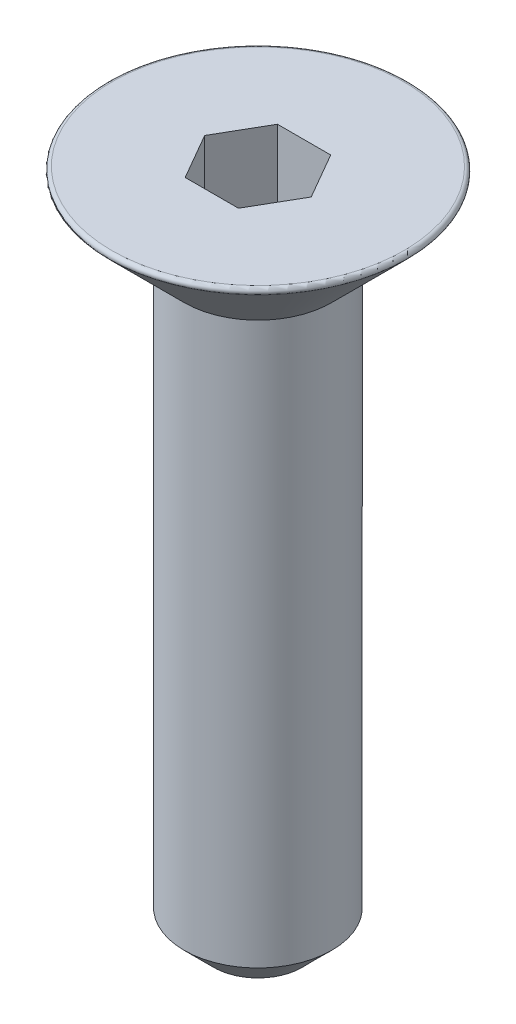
ISO-10303-21;
HEADER;
FILE_DESCRIPTION(('STEP AP214'),'2;1');
FILE_NAME('part.step','',(''),(''),'','','');
FILE_SCHEMA(('AUTOMOTIVE_DESIGN { 1 0 10303 214 1 1 1 1 }'));
ENDSEC;
DATA;
#1=APPLICATION_CONTEXT('core data for automotive mechanical design processes');
#2=APPLICATION_PROTOCOL_DEFINITION('international standard','automotive_design',2000,#1);
#3=PRODUCT_CONTEXT('',#1,'mechanical');
#4=PRODUCT('Part','Part','',(#3));
#5=PRODUCT_RELATED_PRODUCT_CATEGORY('part','',(#4));
#6=PRODUCT_DEFINITION_FORMATION('','',#4);
#7=PRODUCT_DEFINITION_CONTEXT('part definition',#1,'design');
#8=PRODUCT_DEFINITION('design','',#6,#7);
#9=PRODUCT_DEFINITION_SHAPE('','',#8);
#10=(LENGTH_UNIT() NAMED_UNIT(*) SI_UNIT(.MILLI.,.METRE.));
#11=(NAMED_UNIT(*) PLANE_ANGLE_UNIT() SI_UNIT($,.RADIAN.));
#12=(NAMED_UNIT(*) SI_UNIT($,.STERADIAN.) SOLID_ANGLE_UNIT());
#13=UNCERTAINTY_MEASURE_WITH_UNIT(LENGTH_MEASURE(1.E-05),#10,'distance_accuracy_value','');
#14=(GEOMETRIC_REPRESENTATION_CONTEXT(3) GLOBAL_UNCERTAINTY_ASSIGNED_CONTEXT((#13)) GLOBAL_UNIT_ASSIGNED_CONTEXT((#10,
#11,#12)) REPRESENTATION_CONTEXT('',''));
#15=CARTESIAN_POINT('',(0.,0.,0.));
#16=DIRECTION('',(0.,0.,1.));
#17=DIRECTION('',(1.,0.,0.));
#18=AXIS2_PLACEMENT_3D('',#15,#16,#17);
#19=CARTESIAN_POINT('',(0.,0.,0.));
#20=DIRECTION('',(0.,1.,0.));
#21=DIRECTION('',(0.,0.,1.));
#22=AXIS2_PLACEMENT_3D('',#19,#20,#21);
#23=PLANE('',#22);
#24=DIRECTION('',(0.5,0.,-0.866025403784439));
#25=VECTOR('',#24,1.);
#26=CARTESIAN_POINT('',(0.721687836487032,0.,1.25));
#27=LINE('',#26,#25);
#28=CARTESIAN_POINT('',(0.721687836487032,0.,1.25));
#29=VERTEX_POINT('',#28);
#30=CARTESIAN_POINT('',(1.44337567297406,0.,0.));
#31=VERTEX_POINT('',#30);
#32=EDGE_CURVE('E48',#29,#31,#27,.T.);
#33=ORIENTED_EDGE('',*,*,#32,.F.);
#34=DIRECTION('',(1.,0.,0.));
#35=VECTOR('',#34,1.);
#36=CARTESIAN_POINT('',(-0.721687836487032,0.,1.25));
#37=LINE('',#36,#35);
#38=CARTESIAN_POINT('',(-0.721687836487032,0.,1.25));
#39=VERTEX_POINT('',#38);
#40=EDGE_CURVE('E131',#39,#29,#37,.T.);
#41=ORIENTED_EDGE('',*,*,#40,.F.);
#42=DIRECTION('',(0.5,0.,0.866025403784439));
#43=VECTOR('',#42,1.);
#44=CARTESIAN_POINT('',(-1.44337567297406,0.,0.));
#45=LINE('',#44,#43);
#46=CARTESIAN_POINT('',(-1.44337567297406,0.,0.));
#47=VERTEX_POINT('',#46);
#48=EDGE_CURVE('E129',#47,#39,#45,.T.);
#49=ORIENTED_EDGE('',*,*,#48,.F.);
#50=DIRECTION('',(-0.5,0.,0.866025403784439));
#51=VECTOR('',#50,1.);
#52=CARTESIAN_POINT('',(-0.721687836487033,0.,-1.25));
#53=LINE('',#52,#51);
#54=CARTESIAN_POINT('',(-0.721687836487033,0.,-1.25));
#55=VERTEX_POINT('',#54);
#56=EDGE_CURVE('E96',#55,#47,#53,.T.);
#57=ORIENTED_EDGE('',*,*,#56,.F.);
#58=DIRECTION('',(-1.,0.,0.));
#59=VECTOR('',#58,1.);
#60=CARTESIAN_POINT('',(0.721687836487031,0.,-1.25));
#61=LINE('',#60,#59);
#62=CARTESIAN_POINT('',(0.721687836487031,0.,-1.25));
#63=VERTEX_POINT('',#62);
#64=EDGE_CURVE('E125',#63,#55,#61,.T.);
#65=ORIENTED_EDGE('',*,*,#64,.F.);
#66=DIRECTION('',(-0.5,0.,-0.866025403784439));
#67=VECTOR('',#66,1.);
#68=CARTESIAN_POINT('',(1.44337567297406,0.,0.));
#69=LINE('',#68,#67);
#70=EDGE_CURVE('E122',#31,#63,#69,.T.);
#71=ORIENTED_EDGE('',*,*,#70,.F.);
#72=EDGE_LOOP('',(#33,#41,#49,#57,#65,#71));
#73=FACE_BOUND('',#72,.T.);
#74=CARTESIAN_POINT('',(0.,0.,0.));
#75=DIRECTION('',(0.,1.,0.));
#76=DIRECTION('',(0.,0.,1.));
#77=AXIS2_PLACEMENT_3D('',#74,#75,#76);
#78=CIRCLE('',#77,3.95857864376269);
#79=CARTESIAN_POINT('',(0.,0.,3.95857864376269));
#80=VERTEX_POINT('',#79);
#81=EDGE_CURVE('E143',#80,#80,#78,.T.);
#82=ORIENTED_EDGE('',*,*,#81,.T.);
#83=EDGE_LOOP('',(#82));
#84=FACE_BOUND('',#83,.T.);
#85=ADVANCED_FACE('F33',(#73,#84),#23,.T.);
#86=CARTESIAN_POINT('',(0.,0.,0.));
#87=DIRECTION('',(0.,1.,0.));
#88=DIRECTION('',(0.,0.,1.));
#89=AXIS2_PLACEMENT_3D('',#86,#87,#88);
#90=CONICAL_SURFACE('',#89,4.2,0.78539816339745);
#91=CARTESIAN_POINT('',(0.,-0.170710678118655,0.));
#92=DIRECTION('',(0.,-1.,0.));
#93=DIRECTION('',(0.,0.,-1.));
#94=AXIS2_PLACEMENT_3D('',#91,#92,#93);
#95=CIRCLE('',#94,4.02928932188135);
#96=CARTESIAN_POINT('',(0.,-0.170710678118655,-4.02928932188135));
#97=VERTEX_POINT('',#96);
#98=EDGE_CURVE('E146',#97,#97,#95,.T.);
#99=ORIENTED_EDGE('',*,*,#98,.T.);
#100=EDGE_LOOP('',(#99));
#101=FACE_BOUND('',#100,.T.);
#102=CARTESIAN_POINT('',(0.,-2.19999999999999,0.));
#103=DIRECTION('',(0.,1.,0.));
#104=DIRECTION('',(0.,0.,1.));
#105=AXIS2_PLACEMENT_3D('',#102,#103,#104);
#106=CIRCLE('',#105,2.);
#107=CARTESIAN_POINT('',(0.,-2.19999999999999,2.));
#108=VERTEX_POINT('',#107);
#109=EDGE_CURVE('E135',#108,#108,#106,.T.);
#110=ORIENTED_EDGE('',*,*,#109,.T.);
#111=EDGE_LOOP('',(#110));
#112=FACE_BOUND('',#111,.T.);
#113=ADVANCED_FACE('F168',(#101,#112),#90,.T.);
#114=CARTESIAN_POINT('',(0.,15.4879719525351,0.));
#115=DIRECTION('',(0.,1.,0.));
#116=DIRECTION('',(0.,0.,1.));
#117=AXIS2_PLACEMENT_3D('',#114,#115,#116);
#118=CYLINDRICAL_SURFACE('',#117,2.);
#119=CARTESIAN_POINT('',(0.,-17.4,0.));
#120=DIRECTION('',(0.,-1.,0.));
#121=DIRECTION('',(0.,0.,-1.));
#122=AXIS2_PLACEMENT_3D('',#119,#120,#121);
#123=CIRCLE('',#122,2.);
#124=CARTESIAN_POINT('',(0.,-17.4,-2.));
#125=VERTEX_POINT('',#124);
#126=EDGE_CURVE('E41',#125,#125,#123,.F.);
#127=ORIENTED_EDGE('',*,*,#126,.T.);
#128=EDGE_LOOP('',(#127));
#129=FACE_BOUND('',#128,.T.);
#130=ORIENTED_EDGE('',*,*,#109,.F.);
#131=EDGE_LOOP('',(#130));
#132=FACE_BOUND('',#131,.T.);
#133=ADVANCED_FACE('F151',(#129,#132),#118,.T.);
#134=CARTESIAN_POINT('',(2.,-18.2,0.));
#135=DIRECTION('',(0.,-1.,0.));
#136=DIRECTION('',(0.,0.,-1.));
#137=AXIS2_PLACEMENT_3D('',#134,#135,#136);
#138=PLANE('',#137);
#139=CARTESIAN_POINT('',(0.,-18.2,0.));
#140=DIRECTION('',(0.,-1.,0.));
#141=DIRECTION('',(0.,0.,-1.));
#142=AXIS2_PLACEMENT_3D('',#139,#140,#141);
#143=CIRCLE('',#142,1.19999999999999);
#144=CARTESIAN_POINT('',(0.,-18.2,-1.19999999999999));
#145=VERTEX_POINT('',#144);
#146=EDGE_CURVE('E11',#145,#145,#143,.T.);
#147=ORIENTED_EDGE('',*,*,#146,.T.);
#148=EDGE_LOOP('',(#147));
#149=FACE_BOUND('',#148,.T.);
#150=ADVANCED_FACE('F164',(#149),#138,.T.);
#151=CARTESIAN_POINT('',(0.,-0.1,0.));
#152=DIRECTION('',(0.,1.,0.));
#153=DIRECTION('',(0.,0.,1.));
#154=AXIS2_PLACEMENT_3D('',#151,#152,#153);
#155=TOROIDAL_SURFACE('',#154,3.95857864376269,0.1);
#156=ORIENTED_EDGE('',*,*,#98,.F.);
#157=EDGE_LOOP('',(#156));
#158=FACE_BOUND('',#157,.T.);
#159=ORIENTED_EDGE('',*,*,#81,.F.);
#160=EDGE_LOOP('',(#159));
#161=FACE_BOUND('',#160,.T.);
#162=ADVANCED_FACE('F156',(#158,#161),#155,.T.);
#163=CARTESIAN_POINT('',(0.,-17.4,0.));
#164=DIRECTION('',(0.,1.,0.));
#165=DIRECTION('',(0.,0.,1.));
#166=AXIS2_PLACEMENT_3D('',#163,#164,#165);
#167=CONICAL_SURFACE('',#166,2.,0.785398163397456);
#168=ORIENTED_EDGE('',*,*,#146,.F.);
#169=EDGE_LOOP('',(#168));
#170=FACE_BOUND('',#169,.T.);
#171=ORIENTED_EDGE('',*,*,#126,.F.);
#172=EDGE_LOOP('',(#171));
#173=FACE_BOUND('',#172,.T.);
#174=ADVANCED_FACE('F35',(#170,#173),#167,.T.);
#175=CARTESIAN_POINT('',(0.721687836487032,-3.,1.25));
#176=DIRECTION('',(0.866025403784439,0.,0.5));
#177=DIRECTION('',(0.5,0.,-0.866025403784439));
#178=AXIS2_PLACEMENT_3D('',#175,#176,#177);
#179=PLANE('',#178);
#180=ORIENTED_EDGE('',*,*,#32,.T.);
#181=DIRECTION('',(0.,1.,0.));
#182=VECTOR('',#181,1.);
#183=CARTESIAN_POINT('',(1.44337567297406,-3.,0.));
#184=LINE('',#183,#182);
#185=CARTESIAN_POINT('',(1.44337567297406,-3.,0.));
#186=VERTEX_POINT('',#185);
#187=EDGE_CURVE('E78',#186,#31,#184,.T.);
#188=ORIENTED_EDGE('',*,*,#187,.F.);
#189=DIRECTION('',(0.5,0.,-0.866025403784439));
#190=VECTOR('',#189,1.);
#191=CARTESIAN_POINT('',(0.721687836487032,-3.,1.25));
#192=LINE('',#191,#190);
#193=CARTESIAN_POINT('',(0.721687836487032,-3.,1.25));
#194=VERTEX_POINT('',#193);
#195=EDGE_CURVE('E133',#194,#186,#192,.T.);
#196=ORIENTED_EDGE('',*,*,#195,.F.);
#197=DIRECTION('',(0.,1.,0.));
#198=VECTOR('',#197,1.);
#199=CARTESIAN_POINT('',(0.721687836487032,-3.,1.25));
#200=LINE('',#199,#198);
#201=EDGE_CURVE('E56',#194,#29,#200,.T.);
#202=ORIENTED_EDGE('',*,*,#201,.T.);
#203=EDGE_LOOP('',(#180,#188,#196,#202));
#204=FACE_BOUND('',#203,.T.);
#205=ADVANCED_FACE('F155',(#204),#179,.F.);
#206=CARTESIAN_POINT('',(-0.721687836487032,-3.,1.25));
#207=DIRECTION('',(0.,0.,1.));
#208=DIRECTION('',(1.,0.,0.));
#209=AXIS2_PLACEMENT_3D('',#206,#207,#208);
#210=PLANE('',#209);
#211=ORIENTED_EDGE('',*,*,#40,.T.);
#212=ORIENTED_EDGE('',*,*,#201,.F.);
#213=DIRECTION('',(1.,0.,0.));
#214=VECTOR('',#213,1.);
#215=CARTESIAN_POINT('',(-0.721687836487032,-3.,1.25));
#216=LINE('',#215,#214);
#217=CARTESIAN_POINT('',(-0.721687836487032,-3.,1.25));
#218=VERTEX_POINT('',#217);
#219=EDGE_CURVE('E108',#218,#194,#216,.T.);
#220=ORIENTED_EDGE('',*,*,#219,.F.);
#221=DIRECTION('',(0.,1.,0.));
#222=VECTOR('',#221,1.);
#223=CARTESIAN_POINT('',(-0.721687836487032,-3.,1.25));
#224=LINE('',#223,#222);
#225=EDGE_CURVE('E100',#218,#39,#224,.T.);
#226=ORIENTED_EDGE('',*,*,#225,.T.);
#227=EDGE_LOOP('',(#211,#212,#220,#226));
#228=FACE_BOUND('',#227,.T.);
#229=ADVANCED_FACE('F162',(#228),#210,.F.);
#230=CARTESIAN_POINT('',(-1.44337567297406,-3.,0.));
#231=DIRECTION('',(-0.866025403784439,0.,0.5));
#232=DIRECTION('',(0.5,0.,0.866025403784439));
#233=AXIS2_PLACEMENT_3D('',#230,#231,#232);
#234=PLANE('',#233);
#235=ORIENTED_EDGE('',*,*,#48,.T.);
#236=ORIENTED_EDGE('',*,*,#225,.F.);
#237=DIRECTION('',(0.5,0.,0.866025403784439));
#238=VECTOR('',#237,1.);
#239=CARTESIAN_POINT('',(-1.44337567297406,-3.,0.));
#240=LINE('',#239,#238);
#241=CARTESIAN_POINT('',(-1.44337567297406,-3.,0.));
#242=VERTEX_POINT('',#241);
#243=EDGE_CURVE('E104',#242,#218,#240,.T.);
#244=ORIENTED_EDGE('',*,*,#243,.F.);
#245=DIRECTION('',(0.,1.,0.));
#246=VECTOR('',#245,1.);
#247=CARTESIAN_POINT('',(-1.44337567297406,-3.,0.));
#248=LINE('',#247,#246);
#249=EDGE_CURVE('E89',#242,#47,#248,.T.);
#250=ORIENTED_EDGE('',*,*,#249,.T.);
#251=EDGE_LOOP('',(#235,#236,#244,#250));
#252=FACE_BOUND('',#251,.T.);
#253=ADVANCED_FACE('F105',(#252),#234,.F.);
#254=CARTESIAN_POINT('',(-0.721687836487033,-3.,-1.25));
#255=DIRECTION('',(-0.866025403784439,0.,-0.5));
#256=DIRECTION('',(-0.5,0.,0.866025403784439));
#257=AXIS2_PLACEMENT_3D('',#254,#255,#256);
#258=PLANE('',#257);
#259=ORIENTED_EDGE('',*,*,#56,.T.);
#260=ORIENTED_EDGE('',*,*,#249,.F.);
#261=DIRECTION('',(-0.5,0.,0.866025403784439));
#262=VECTOR('',#261,1.);
#263=CARTESIAN_POINT('',(-0.721687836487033,-3.,-1.25));
#264=LINE('',#263,#262);
#265=CARTESIAN_POINT('',(-0.721687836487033,-3.,-1.25));
#266=VERTEX_POINT('',#265);
#267=EDGE_CURVE('E93',#266,#242,#264,.T.);
#268=ORIENTED_EDGE('',*,*,#267,.F.);
#269=DIRECTION('',(0.,1.,0.));
#270=VECTOR('',#269,1.);
#271=CARTESIAN_POINT('',(-0.721687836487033,-3.,-1.25));
#272=LINE('',#271,#270);
#273=EDGE_CURVE('E101',#266,#55,#272,.T.);
#274=ORIENTED_EDGE('',*,*,#273,.T.);
#275=EDGE_LOOP('',(#259,#260,#268,#274));
#276=FACE_BOUND('',#275,.T.);
#277=ADVANCED_FACE('F91',(#276),#258,.F.);
#278=CARTESIAN_POINT('',(0.721687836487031,-3.,-1.25));
#279=DIRECTION('',(0.,0.,-1.));
#280=DIRECTION('',(-1.,0.,0.));
#281=AXIS2_PLACEMENT_3D('',#278,#279,#280);
#282=PLANE('',#281);
#283=ORIENTED_EDGE('',*,*,#64,.T.);
#284=ORIENTED_EDGE('',*,*,#273,.F.);
#285=DIRECTION('',(-1.,0.,0.));
#286=VECTOR('',#285,1.);
#287=CARTESIAN_POINT('',(0.721687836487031,-3.,-1.25));
#288=LINE('',#287,#286);
#289=CARTESIAN_POINT('',(0.721687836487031,-3.,-1.25));
#290=VERTEX_POINT('',#289);
#291=EDGE_CURVE('E114',#290,#266,#288,.T.);
#292=ORIENTED_EDGE('',*,*,#291,.F.);
#293=DIRECTION('',(0.,1.,0.));
#294=VECTOR('',#293,1.);
#295=CARTESIAN_POINT('',(0.721687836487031,-3.,-1.25));
#296=LINE('',#295,#294);
#297=EDGE_CURVE('E138',#290,#63,#296,.T.);
#298=ORIENTED_EDGE('',*,*,#297,.T.);
#299=EDGE_LOOP('',(#283,#284,#292,#298));
#300=FACE_BOUND('',#299,.T.);
#301=ADVANCED_FACE('F186',(#300),#282,.F.);
#302=CARTESIAN_POINT('',(1.44337567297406,-3.,0.));
#303=DIRECTION('',(0.866025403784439,0.,-0.5));
#304=DIRECTION('',(-0.5,0.,-0.866025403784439));
#305=AXIS2_PLACEMENT_3D('',#302,#303,#304);
#306=PLANE('',#305);
#307=ORIENTED_EDGE('',*,*,#70,.T.);
#308=ORIENTED_EDGE('',*,*,#297,.F.);
#309=DIRECTION('',(-0.5,0.,-0.866025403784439));
#310=VECTOR('',#309,1.);
#311=CARTESIAN_POINT('',(1.44337567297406,-3.,0.));
#312=LINE('',#311,#310);
#313=EDGE_CURVE('E116',#186,#290,#312,.T.);
#314=ORIENTED_EDGE('',*,*,#313,.F.);
#315=ORIENTED_EDGE('',*,*,#187,.T.);
#316=EDGE_LOOP('',(#307,#308,#314,#315));
#317=FACE_BOUND('',#316,.T.);
#318=ADVANCED_FACE('F183',(#317),#306,.F.);
#319=CARTESIAN_POINT('',(1.44337567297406,-3.,0.));
#320=DIRECTION('',(0.,1.,0.));
#321=DIRECTION('',(0.,0.,1.));
#322=AXIS2_PLACEMENT_3D('',#319,#320,#321);
#323=PLANE('',#322);
#324=ORIENTED_EDGE('',*,*,#195,.T.);
#325=ORIENTED_EDGE('',*,*,#313,.T.);
#326=ORIENTED_EDGE('',*,*,#291,.T.);
#327=ORIENTED_EDGE('',*,*,#267,.T.);
#328=ORIENTED_EDGE('',*,*,#243,.T.);
#329=ORIENTED_EDGE('',*,*,#219,.T.);
#330=EDGE_LOOP('',(#324,#325,#326,#327,#328,#329));
#331=FACE_BOUND('',#330,.T.);
#332=ADVANCED_FACE('F111',(#331),#323,.T.);
#333=CLOSED_SHELL('',(#85,#113,#133,#150,#162,#174,#205,#229,#253,#277,#301,#318,#332));
#334=MANIFOLD_SOLID_BREP('B2',#333);
#335=ADVANCED_BREP_SHAPE_REPRESENTATION('',(#18,#334),#14);
#336=SHAPE_DEFINITION_REPRESENTATION(#9,#335);
ENDSEC;
END-ISO-10303-21;
